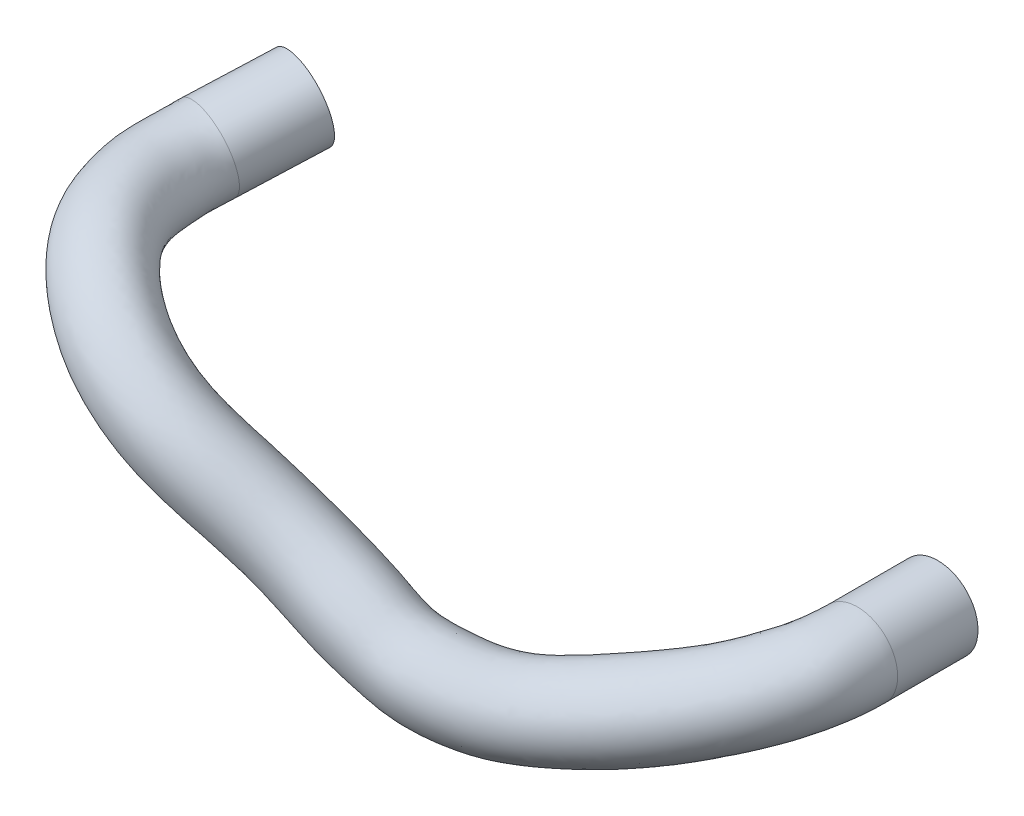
ISO-10303-21;
HEADER;
FILE_DESCRIPTION(('STEP AP214'),'2;1');
FILE_NAME('part.step','',(''),(''),'','','');
FILE_SCHEMA(('AUTOMOTIVE_DESIGN { 1 0 10303 214 1 1 1 1 }'));
ENDSEC;
DATA;
#1=APPLICATION_CONTEXT('core data for automotive mechanical design processes');
#2=APPLICATION_PROTOCOL_DEFINITION('international standard','automotive_design',2000,#1);
#3=PRODUCT_CONTEXT('',#1,'mechanical');
#4=PRODUCT('Part','Part','',(#3));
#5=PRODUCT_RELATED_PRODUCT_CATEGORY('part','',(#4));
#6=PRODUCT_DEFINITION_FORMATION('','',#4);
#7=PRODUCT_DEFINITION_CONTEXT('part definition',#1,'design');
#8=PRODUCT_DEFINITION('design','',#6,#7);
#9=PRODUCT_DEFINITION_SHAPE('','',#8);
#10=(LENGTH_UNIT() NAMED_UNIT(*) SI_UNIT(.MILLI.,.METRE.));
#11=(NAMED_UNIT(*) PLANE_ANGLE_UNIT() SI_UNIT($,.RADIAN.));
#12=(NAMED_UNIT(*) SI_UNIT($,.STERADIAN.) SOLID_ANGLE_UNIT());
#13=UNCERTAINTY_MEASURE_WITH_UNIT(LENGTH_MEASURE(1.E-05),#10,'distance_accuracy_value','');
#14=(GEOMETRIC_REPRESENTATION_CONTEXT(3) GLOBAL_UNCERTAINTY_ASSIGNED_CONTEXT((#13)) GLOBAL_UNIT_ASSIGNED_CONTEXT((#10,
#11,#12)) REPRESENTATION_CONTEXT('',''));
#15=CARTESIAN_POINT('',(0.,0.,0.));
#16=DIRECTION('',(0.,0.,1.));
#17=DIRECTION('',(1.,0.,0.));
#18=AXIS2_PLACEMENT_3D('',#15,#16,#17);
#19=CARTESIAN_POINT('',(-94.279147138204,39.7528350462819,21.0147487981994));
#20=DIRECTION('',(0.226583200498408,0.181835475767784,-0.95686776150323));
#21=DIRECTION('',(-0.973090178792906,0.,-0.230424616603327));
#22=AXIS2_PLACEMENT_3D('',#19,#20,#21);
#23=CYLINDRICAL_SURFACE('',#22,6.35);
#24=CARTESIAN_POINT('',(-94.279147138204,39.7528350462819,21.0147487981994));
#25=DIRECTION('',(0.226583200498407,0.181835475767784,-0.95686776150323));
#26=DIRECTION('',(-0.441291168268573,-0.856633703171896,-0.267284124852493));
#27=AXIS2_PLACEMENT_3D('',#24,#25,#26);
#28=CIRCLE('',#27,6.35);
#29=CARTESIAN_POINT('',(-97.0813460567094,34.3132110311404,19.3174946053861));
#30=VERTEX_POINT('',#29);
#31=EDGE_CURVE('E46',#30,#30,#28,.T.);
#32=ORIENTED_EDGE('',*,*,#31,.T.);
#33=EDGE_LOOP('',(#32));
#34=FACE_BOUND('',#33,.T.);
#35=CARTESIAN_POINT('',(-91.4015404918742,42.0621455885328,8.86252822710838));
#36=DIRECTION('',(0.226583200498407,0.181835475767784,-0.95686776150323));
#37=DIRECTION('',(-0.441291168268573,-0.856633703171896,-0.267284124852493));
#38=AXIS2_PLACEMENT_3D('',#35,#36,#37);
#39=CIRCLE('',#38,6.35);
#40=CARTESIAN_POINT('',(-94.2037394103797,36.6225215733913,7.16527403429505));
#41=VERTEX_POINT('',#40);
#42=EDGE_CURVE('E10',#41,#41,#39,.T.);
#43=ORIENTED_EDGE('',*,*,#42,.F.);
#44=EDGE_LOOP('',(#43));
#45=FACE_BOUND('',#44,.T.);
#46=ADVANCED_FACE('F31',(#34,#45),#23,.T.);
#47=CARTESIAN_POINT('',(0.,13.5635999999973,12.7));
#48=DIRECTION('',(0.,0.,-1.));
#49=DIRECTION('',(0.,1.,0.));
#50=AXIS2_PLACEMENT_3D('',#47,#48,#49);
#51=CYLINDRICAL_SURFACE('',#50,6.35);
#52=CARTESIAN_POINT('',(0.,13.5635999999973,12.7));
#53=DIRECTION('',(0.,0.,1.));
#54=DIRECTION('',(1.,0.,0.));
#55=AXIS2_PLACEMENT_3D('',#52,#53,#54);
#56=CIRCLE('',#55,6.35);
#57=CARTESIAN_POINT('',(6.35000000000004,13.5635999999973,12.7));
#58=VERTEX_POINT('',#57);
#59=EDGE_CURVE('E37',#58,#58,#56,.T.);
#60=ORIENTED_EDGE('',*,*,#59,.F.);
#61=EDGE_LOOP('',(#60));
#62=FACE_BOUND('',#61,.T.);
#63=CARTESIAN_POINT('',(0.,13.5635999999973,0.));
#64=DIRECTION('',(0.,0.,1.));
#65=DIRECTION('',(1.,0.,0.));
#66=AXIS2_PLACEMENT_3D('',#63,#64,#65);
#67=CIRCLE('',#66,6.35);
#68=CARTESIAN_POINT('',(6.35000000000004,13.5635999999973,0.));
#69=VERTEX_POINT('',#68);
#70=EDGE_CURVE('E41',#69,#69,#67,.T.);
#71=ORIENTED_EDGE('',*,*,#70,.T.);
#72=EDGE_LOOP('',(#71));
#73=FACE_BOUND('',#72,.T.);
#74=ADVANCED_FACE('F65',(#62,#73),#51,.T.);
#75=CARTESIAN_POINT('',(0.,13.5635999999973,0.));
#76=DIRECTION('',(0.,0.,1.));
#77=DIRECTION('',(1.,0.,0.));
#78=AXIS2_PLACEMENT_3D('',#75,#76,#77);
#79=PLANE('',#78);
#80=ORIENTED_EDGE('',*,*,#70,.F.);
#81=EDGE_LOOP('',(#80));
#82=FACE_BOUND('',#81,.T.);
#83=ADVANCED_FACE('F60',(#82),#79,.F.);
#84=CARTESIAN_POINT('',(-91.4015404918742,42.0621455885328,8.86252822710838));
#85=DIRECTION('',(0.226583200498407,0.181835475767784,-0.95686776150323));
#86=DIRECTION('',(-0.441291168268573,-0.856633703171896,-0.267284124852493));
#87=AXIS2_PLACEMENT_3D('',#84,#85,#86);
#88=PLANE('',#87);
#89=ORIENTED_EDGE('',*,*,#42,.T.);
#90=EDGE_LOOP('',(#89));
#91=FACE_BOUND('',#90,.T.);
#92=ADVANCED_FACE('F55',(#91),#88,.T.);
#93=CARTESIAN_POINT('',(6.35000000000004,13.5635999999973,12.7));
#94=CARTESIAN_POINT('',(6.35000000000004,13.5635999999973,14.0645834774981));
#95=CARTESIAN_POINT('',(5.80663605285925,13.106678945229,18.7796954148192));
#96=CARTESIAN_POINT('',(3.59028185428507,11.9020348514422,23.5114566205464));
#97=CARTESIAN_POINT('',(0.505322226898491,10.2530971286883,27.8017252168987));
#98=CARTESIAN_POINT('',(-6.25751405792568,5.97402071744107,33.6907745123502));
#99=CARTESIAN_POINT('',(-16.6697770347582,2.92885885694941,40.4997318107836));
#100=CARTESIAN_POINT('',(-26.0060171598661,5.66570988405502,47.5004697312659));
#101=CARTESIAN_POINT('',(-36.9519116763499,8.79140450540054,51.3262998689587));
#102=CARTESIAN_POINT('',(-45.2379627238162,7.58796130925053,50.6952625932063));
#103=CARTESIAN_POINT('',(-54.5888220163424,13.7637111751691,51.4137757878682));
#104=CARTESIAN_POINT('',(-61.097280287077,19.4524756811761,53.7058687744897));
#105=CARTESIAN_POINT('',(-71.4328861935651,25.8590055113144,57.1067717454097));
#106=CARTESIAN_POINT('',(-80.793957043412,32.7551296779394,56.2911879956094));
#107=CARTESIAN_POINT('',(-87.0366817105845,37.0667230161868,52.9226959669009));
#108=CARTESIAN_POINT('',(-91.01746200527,39.3430968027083,49.8572206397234));
#109=CARTESIAN_POINT('',(-94.7532728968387,41.5415792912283,45.3618164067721));
#110=CARTESIAN_POINT('',(-98.7163685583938,40.4695267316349,39.734156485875));
#111=CARTESIAN_POINT('',(-100.498509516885,37.5771419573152,33.7426491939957));
#112=CARTESIAN_POINT('',(-100.144042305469,34.621746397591,27.7058973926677));
#113=CARTESIAN_POINT('',(-97.5381038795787,33.9466579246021,21.2463968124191));
#114=CARTESIAN_POINT('',(-97.0813460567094,34.3132110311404,19.3174946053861));
#115=CARTESIAN_POINT('',(6.35000000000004,26.2635999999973,12.7));
#116=CARTESIAN_POINT('',(6.35000000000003,26.2635999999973,12.3751950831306));
#117=CARTESIAN_POINT('',(6.08265727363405,25.739648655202,21.3807908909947));
#118=CARTESIAN_POINT('',(3.8135744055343,24.2458499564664,26.271373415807));
#119=CARTESIAN_POINT('',(0.915056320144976,22.2791173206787,32.1033990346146));
#120=CARTESIAN_POINT('',(-3.85520667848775,16.3073148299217,41.0718518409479));
#121=CARTESIAN_POINT('',(-14.0379983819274,13.5859504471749,48.0885202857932));
#122=CARTESIAN_POINT('',(-25.2172118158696,18.5432847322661,48.3556604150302));
#123=CARTESIAN_POINT('',(-32.4149164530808,21.1364789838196,49.4643025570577));
#124=CARTESIAN_POINT('',(-39.9335351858,17.310178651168,57.950216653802));
#125=CARTESIAN_POINT('',(-48.1563949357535,23.2085262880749,56.7823022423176));
#126=CARTESIAN_POINT('',(-53.243295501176,29.1544167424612,56.504425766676));
#127=CARTESIAN_POINT('',(-64.1846527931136,35.498282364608,61.1622609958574));
#128=CARTESIAN_POINT('',(-74.8838959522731,43.7449374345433,58.9638853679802));
#129=CARTESIAN_POINT('',(-81.4789151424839,48.4415200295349,54.0587618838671));
#130=CARTESIAN_POINT('',(-85.926214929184,50.9934516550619,50.1752187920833));
#131=CARTESIAN_POINT('',(-89.4432332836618,53.0584382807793,44.1132457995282));
#132=CARTESIAN_POINT('',(-96.7386593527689,53.305827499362,39.5018028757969));
#133=CARTESIAN_POINT('',(-103.949829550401,50.3294692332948,34.0328403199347));
#134=CARTESIAN_POINT('',(-109.34702120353,44.245179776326,29.6946727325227));
#135=CARTESIAN_POINT('',(-108.188729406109,40.3807043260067,18.2099500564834));
#136=CARTESIAN_POINT('',(-108.108589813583,40.4450172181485,17.8715181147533));
#137=CARTESIAN_POINT('',(-6.34999999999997,26.2635999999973,12.7));
#138=CARTESIAN_POINT('',(-6.34999999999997,26.2635999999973,12.3751950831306));
#139=CARTESIAN_POINT('',(-6.28082375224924,26.3151402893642,17.3946576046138));
#140=CARTESIAN_POINT('',(-7.32752947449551,25.8607444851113,20.3613399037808));
#141=CARTESIAN_POINT('',(-8.98406934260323,25.2232173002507,24.5288614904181));
#142=CARTESIAN_POINT('',(-11.5682478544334,23.5435440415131,33.4172336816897));
#143=CARTESIAN_POINT('',(-20.9194247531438,21.253174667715,39.6812429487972));
#144=CARTESIAN_POINT('',(-30.8872271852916,19.951189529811,36.8393732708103));
#145=CARTESIAN_POINT('',(-34.8100436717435,20.3462297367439,36.4154430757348));
#146=CARTESIAN_POINT('',(-37.3684455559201,24.1242471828,46.9517172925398));
#147=CARTESIAN_POINT('',(-45.8652617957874,28.0991763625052,45.3329433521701));
#148=CARTESIAN_POINT('',(-54.8590922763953,33.8256152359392,44.6985706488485));
#149=CARTESIAN_POINT('',(-63.5653390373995,39.8999882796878,49.0131582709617));
#150=CARTESIAN_POINT('',(-70.8165072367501,44.3580389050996,46.6717042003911));
#151=CARTESIAN_POINT('',(-75.4690117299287,46.5687963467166,42.9696035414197));
#152=CARTESIAN_POINT('',(-78.3768052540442,47.8920357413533,40.3060746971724));
#153=CARTESIAN_POINT('',(-80.4108966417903,47.9833875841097,36.5133723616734));
#154=CARTESIAN_POINT('',(-84.7797819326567,51.2755105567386,34.4568771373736));
#155=CARTESIAN_POINT('',(-91.6084790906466,53.861563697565,31.3169551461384));
#156=CARTESIAN_POINT('',(-99.191854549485,53.3141352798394,28.6211491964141));
#157=CARTESIAN_POINT('',(-102.584331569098,51.2599523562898,21.6044584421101));
#158=CARTESIAN_POINT('',(-102.504191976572,51.3242652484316,21.26602650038));
#159=CARTESIAN_POINT('',(-6.34999999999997,13.5635999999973,12.7));
#160=CARTESIAN_POINT('',(-6.34999999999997,13.5635999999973,13.2198892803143));
#161=CARTESIAN_POINT('',(-6.55684497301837,13.6821705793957,15.1799701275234));
#162=CARTESIAN_POINT('',(-7.55082202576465,13.5169293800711,17.4944545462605));
#163=CARTESIAN_POINT('',(-9.39380343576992,13.1971971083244,20.2577211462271));
#164=CARTESIAN_POINT('',(-13.9705552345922,13.2102499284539,25.998668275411));
#165=CARTESIAN_POINT('',(-23.5512033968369,10.5960830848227,32.0995203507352));
#166=CARTESIAN_POINT('',(-31.6760325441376,7.07361466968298,35.9830289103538));
#167=CARTESIAN_POINT('',(-39.3470388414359,8.00115530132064,38.2778047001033));
#168=CARTESIAN_POINT('',(-42.6728733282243,14.4020296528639,39.6966757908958));
#169=CARTESIAN_POINT('',(-52.2976880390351,18.6543619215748,39.9644438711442));
#170=CARTESIAN_POINT('',(-62.7130813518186,24.1236707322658,41.9000227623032));
#171=CARTESIAN_POINT('',(-70.8135566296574,30.2607241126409,44.9576048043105));
#172=CARTESIAN_POINT('',(-76.7266134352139,33.3681949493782,43.9991970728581));
#173=CARTESIAN_POINT('',(-81.0267184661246,35.194047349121,41.8332849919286));
#174=CARTESIAN_POINT('',(-83.468280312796,36.241497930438,39.9890393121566));
#175=CARTESIAN_POINT('',(-85.7200495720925,36.467240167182,37.7581984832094));
#176=CARTESIAN_POINT('',(-86.7621590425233,38.4354637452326,34.7089434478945));
#177=CARTESIAN_POINT('',(-88.1279072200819,41.1327113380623,30.903232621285));
#178=CARTESIAN_POINT('',(-90.0930950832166,43.6070646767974,27.0724956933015));
#179=CARTESIAN_POINT('',(-91.7453969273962,44.9770260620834,23.8456700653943));
#180=CARTESIAN_POINT('',(-91.4769482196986,45.1924590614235,22.7120029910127));
#181=CARTESIAN_POINT('',(-6.34999999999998,0.86359999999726,12.7));
#182=CARTESIAN_POINT('',(-6.34999999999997,0.86359999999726,14.0645834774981));
#183=CARTESIAN_POINT('',(-6.83286619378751,1.04920086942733,12.9652826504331));
#184=CARTESIAN_POINT('',(-7.7741145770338,1.173114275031,14.6275691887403));
#185=CARTESIAN_POINT('',(-9.8035375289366,1.17117691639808,15.9865808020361));
#186=CARTESIAN_POINT('',(-16.372862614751,2.87695581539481,18.5801028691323));
#187=CARTESIAN_POINT('',(-26.1829820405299,-0.0610084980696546,24.5177977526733));
#188=CARTESIAN_POINT('',(-32.4648379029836,-5.803960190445,35.1266845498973));
#189=CARTESIAN_POINT('',(-43.8840340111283,-4.34391913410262,40.1401663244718));
#190=CARTESIAN_POINT('',(-47.9773011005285,4.6798121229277,32.4416342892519));
#191=CARTESIAN_POINT('',(-58.7301142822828,9.20954748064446,34.5959443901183));
#192=CARTESIAN_POINT('',(-70.567070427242,14.4217262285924,39.1014748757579));
#193=CARTESIAN_POINT('',(-78.0617742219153,20.6214599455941,40.9020513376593));
#194=CARTESIAN_POINT('',(-82.6367196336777,22.3783509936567,41.326689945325));
#195=CARTESIAN_POINT('',(-86.5844252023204,23.8192983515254,40.6969664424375));
#196=CARTESIAN_POINT('',(-88.5597553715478,24.5909601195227,39.6720039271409));
#197=CARTESIAN_POINT('',(-91.0292025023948,24.9510927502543,39.0030246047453));
#198=CARTESIAN_POINT('',(-88.7445361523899,25.5954169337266,34.9610097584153));
#199=CARTESIAN_POINT('',(-84.6473353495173,28.4038589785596,30.4895100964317));
#200=CARTESIAN_POINT('',(-80.9943356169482,33.8999940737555,25.5238421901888));
#201=CARTESIAN_POINT('',(-80.9064622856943,38.694099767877,26.0868816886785));
#202=CARTESIAN_POINT('',(-80.449704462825,39.0606528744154,24.1579794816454));
#203=CARTESIAN_POINT('',(6.35000000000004,0.86359999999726,12.7));
#204=CARTESIAN_POINT('',(6.35000000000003,0.86359999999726,15.7539718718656));
#205=CARTESIAN_POINT('',(5.53061483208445,0.473709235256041,16.1785999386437));
#206=CARTESIAN_POINT('',(3.36698930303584,-0.441780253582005,20.7515398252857));
#207=CARTESIAN_POINT('',(0.095588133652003,-1.77292306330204,23.5000513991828));
#208=CARTESIAN_POINT('',(-8.65982143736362,-4.35927339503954,26.3096971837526));
#209=CARTESIAN_POINT('',(-19.301555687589,-7.72823273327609,32.9109433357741));
#210=CARTESIAN_POINT('',(-26.7948225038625,-7.21186496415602,46.6452790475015));
#211=CARTESIAN_POINT('',(-41.4889068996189,-3.55366997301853,53.1882971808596));
#212=CARTESIAN_POINT('',(-50.5423902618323,-2.13425603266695,43.4403085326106));
#213=CARTESIAN_POINT('',(-61.0212490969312,4.31889606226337,46.0452493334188));
#214=CARTESIAN_POINT('',(-68.951265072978,9.75053461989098,50.9073117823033));
#215=CARTESIAN_POINT('',(-78.6811195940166,16.2197286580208,53.051282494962));
#216=CARTESIAN_POINT('',(-86.7040181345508,21.7653219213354,53.6184906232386));
#217=CARTESIAN_POINT('',(-92.5944482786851,25.6919260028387,51.7866300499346));
#218=CARTESIAN_POINT('',(-96.1087090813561,27.6927419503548,49.5392224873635));
#219=CARTESIAN_POINT('',(-100.063312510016,30.0247203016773,46.6103870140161));
#220=CARTESIAN_POINT('',(-100.694077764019,27.6332259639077,39.966510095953));
#221=CARTESIAN_POINT('',(-97.0471894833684,24.8248146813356,33.4524580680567));
#222=CARTESIAN_POINT('',(-90.9410634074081,24.998313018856,25.7171220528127));
#223=CARTESIAN_POINT('',(-86.8874783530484,27.5126115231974,24.2828435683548));
#224=CARTESIAN_POINT('',(-86.0541022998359,28.1814048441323,20.7634710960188));
#225=CARTESIAN_POINT('',(6.35000000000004,13.5635999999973,12.7));
#226=CARTESIAN_POINT('',(6.35000000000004,13.5635999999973,14.0645834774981));
#227=CARTESIAN_POINT('',(5.80663605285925,13.106678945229,18.7796954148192));
#228=CARTESIAN_POINT('',(3.59028185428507,11.9020348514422,23.5114566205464));
#229=CARTESIAN_POINT('',(0.505322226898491,10.2530971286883,27.8017252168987));
#230=CARTESIAN_POINT('',(-6.25751405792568,5.97402071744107,33.6907745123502));
#231=CARTESIAN_POINT('',(-16.6697770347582,2.92885885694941,40.4997318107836));
#232=CARTESIAN_POINT('',(-26.0060171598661,5.66570988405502,47.5004697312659));
#233=CARTESIAN_POINT('',(-36.9519116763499,8.79140450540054,51.3262998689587));
#234=CARTESIAN_POINT('',(-45.2379627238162,7.58796130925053,50.6952625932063));
#235=CARTESIAN_POINT('',(-54.5888220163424,13.7637111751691,51.4137757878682));
#236=CARTESIAN_POINT('',(-61.097280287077,19.4524756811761,53.7058687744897));
#237=CARTESIAN_POINT('',(-71.4328861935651,25.8590055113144,57.1067717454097));
#238=CARTESIAN_POINT('',(-80.793957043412,32.7551296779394,56.2911879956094));
#239=CARTESIAN_POINT('',(-87.0366817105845,37.0667230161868,52.9226959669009));
#240=CARTESIAN_POINT('',(-91.01746200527,39.3430968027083,49.8572206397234));
#241=CARTESIAN_POINT('',(-94.7532728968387,41.5415792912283,45.3618164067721));
#242=CARTESIAN_POINT('',(-98.7163685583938,40.4695267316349,39.734156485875));
#243=CARTESIAN_POINT('',(-100.498509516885,37.5771419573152,33.7426491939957));
#244=CARTESIAN_POINT('',(-100.144042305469,34.621746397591,27.7058973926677));
#245=CARTESIAN_POINT('',(-97.5381038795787,33.9466579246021,21.2463968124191));
#246=CARTESIAN_POINT('',(-97.0813460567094,34.3132110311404,19.3174946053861));
#247=(BOUNDED_SURFACE() B_SPLINE_SURFACE(3,3,((#93,#94,#95,#96,#97,#98,#99,#100,#101,#102,#103,
#104,#105,#106,#107,#108,#109,#110,#111,#112,#113,#114),(#115,#116,#117,#118,#119,#120,#121,
#122,#123,#124,#125,#126,#127,#128,#129,#130,#131,#132,#133,#134,#135,#136),(#137,#138,#139,
#140,#141,#142,#143,#144,#145,#146,#147,#148,#149,#150,#151,#152,#153,#154,#155,#156,#157,#158),
(#159,#160,#161,#162,#163,#164,#165,#166,#167,#168,#169,#170,#171,#172,#173,#174,#175,#176,#177,
#178,#179,#180),(#181,#182,#183,#184,#185,#186,#187,#188,#189,#190,#191,#192,#193,#194,#195,
#196,#197,#198,#199,#200,#201,#202),(#203,#204,#205,#206,#207,#208,#209,#210,#211,#212,#213,
#214,#215,#216,#217,#218,#219,#220,#221,#222,#223,#224),(#225,#226,#227,#228,#229,#230,#231,
#232,#233,#234,#235,#236,#237,#238,#239,#240,#241,#242,#243,#244,#245,#246)),.UNSPECIFIED.,.T.,
.F.,.F.) B_SPLINE_SURFACE_WITH_KNOTS((4,3,4),(4,1,1,1,1,1,1,1,1,1,1,1,1,1,1,1,1,1,1,4),(0.,0.5,
1.),(0.,0.0290417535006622,0.0577370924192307,0.0875573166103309,0.119727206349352,
0.244658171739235,0.307470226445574,0.363045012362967,0.430391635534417,0.488371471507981,
0.565452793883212,0.641510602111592,0.719602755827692,0.750257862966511,0.780767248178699,
0.81103474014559,0.844819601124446,0.898181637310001,0.953330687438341,1.),
.UNSPECIFIED.) GEOMETRIC_REPRESENTATION_ITEM() RATIONAL_B_SPLINE_SURFACE(((1.,1.,1.,1.,1.,1.,1.,
1.,1.,1.,1.,1.,1.,1.,1.,1.,1.,1.,1.,1.,1.,1.),(0.333333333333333,0.333333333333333,
0.333333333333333,0.333333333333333,0.333333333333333,0.333333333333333,0.333333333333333,
0.333333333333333,0.333333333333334,0.333333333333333,0.333333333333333,0.333333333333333,
0.333333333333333,0.333333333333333,0.333333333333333,0.333333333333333,0.333333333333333,
0.333333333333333,0.333333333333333,0.333333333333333,0.333333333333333,0.333333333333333),
(0.333333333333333,0.333333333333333,0.333333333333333,0.333333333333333,0.333333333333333,
0.333333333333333,0.333333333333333,0.333333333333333,0.333333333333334,0.333333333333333,
0.333333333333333,0.333333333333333,0.333333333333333,0.333333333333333,0.333333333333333,
0.333333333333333,0.333333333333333,0.333333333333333,0.333333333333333,0.333333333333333,
0.333333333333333,0.333333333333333),(1.,1.,1.,1.,1.,1.,1.,1.,1.,1.,1.,1.,1.,1.,1.,1.,1.,1.,1.,
1.,1.,1.),(0.333333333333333,0.333333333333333,0.333333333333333,0.333333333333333,
0.333333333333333,0.333333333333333,0.333333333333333,0.333333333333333,0.333333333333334,
0.333333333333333,0.333333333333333,0.333333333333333,0.333333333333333,0.333333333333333,
0.333333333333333,0.333333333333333,0.333333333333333,0.333333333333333,0.333333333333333,
0.333333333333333,0.333333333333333,0.333333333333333),(0.333333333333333,0.333333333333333,
0.333333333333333,0.333333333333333,0.333333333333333,0.333333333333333,0.333333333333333,
0.333333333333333,0.333333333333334,0.333333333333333,0.333333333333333,0.333333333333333,
0.333333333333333,0.333333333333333,0.333333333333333,0.333333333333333,0.333333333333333,
0.333333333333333,0.333333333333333,0.333333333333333,0.333333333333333,0.333333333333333),(1.,
1.,1.,1.,1.,1.,1.,1.,1.,1.,1.,1.,1.,1.,1.,1.,1.,1.,1.,1.,1.,1.))) REPRESENTATION_ITEM('') SURFACE());
#248=ORIENTED_EDGE('',*,*,#59,.T.);
#249=EDGE_LOOP('',(#248));
#250=FACE_BOUND('',#249,.T.);
#251=ORIENTED_EDGE('',*,*,#31,.F.);
#252=EDGE_LOOP('',(#251));
#253=FACE_BOUND('',#252,.T.);
#254=ADVANCED_FACE('F53',(#250,#253),#247,.T.);
#255=CLOSED_SHELL('',(#46,#74,#83,#92,#254));
#256=MANIFOLD_SOLID_BREP('B2',#255);
#257=ADVANCED_BREP_SHAPE_REPRESENTATION('',(#18,#256),#14);
#258=SHAPE_DEFINITION_REPRESENTATION(#9,#257);
ENDSEC;
END-ISO-10303-21;
